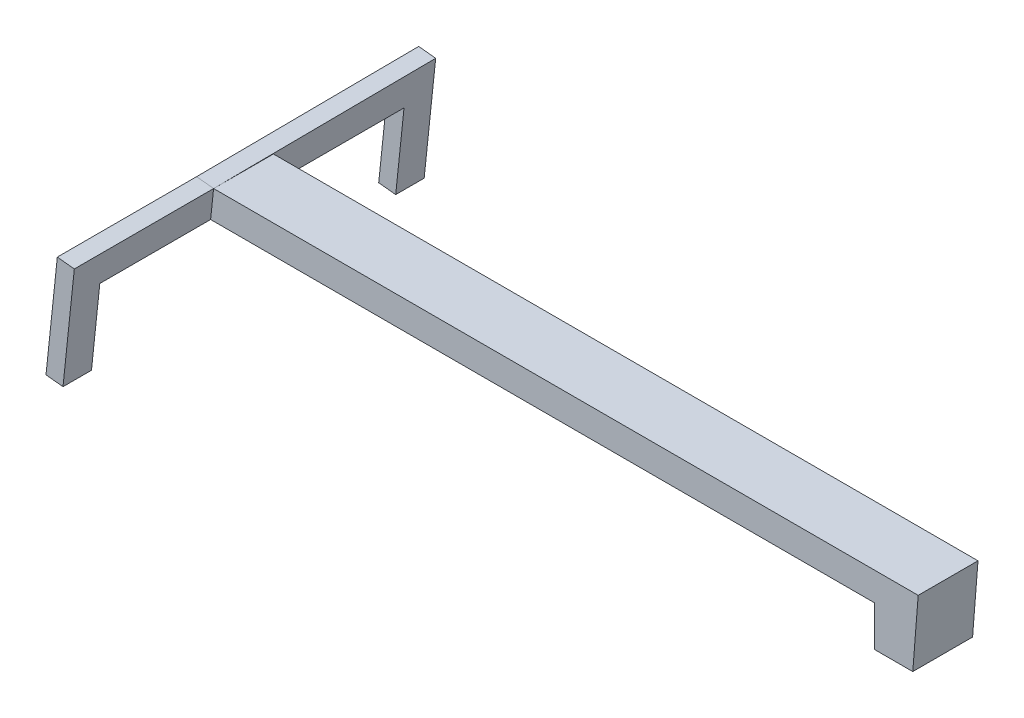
ISO-10303-21;
HEADER;
FILE_DESCRIPTION(('STEP AP214'),'2;1');
FILE_NAME('part.step','',(''),(''),'','','');
FILE_SCHEMA(('AUTOMOTIVE_DESIGN { 1 0 10303 214 1 1 1 1 }'));
ENDSEC;
DATA;
#1=APPLICATION_CONTEXT('core data for automotive mechanical design processes');
#2=APPLICATION_PROTOCOL_DEFINITION('international standard','automotive_design',2000,#1);
#3=PRODUCT_CONTEXT('',#1,'mechanical');
#4=PRODUCT('Part','Part','',(#3));
#5=PRODUCT_RELATED_PRODUCT_CATEGORY('part','',(#4));
#6=PRODUCT_DEFINITION_FORMATION('','',#4);
#7=PRODUCT_DEFINITION_CONTEXT('part definition',#1,'design');
#8=PRODUCT_DEFINITION('design','',#6,#7);
#9=PRODUCT_DEFINITION_SHAPE('','',#8);
#10=(LENGTH_UNIT() NAMED_UNIT(*) SI_UNIT(.MILLI.,.METRE.));
#11=(NAMED_UNIT(*) PLANE_ANGLE_UNIT() SI_UNIT($,.RADIAN.));
#12=(NAMED_UNIT(*) SI_UNIT($,.STERADIAN.) SOLID_ANGLE_UNIT());
#13=UNCERTAINTY_MEASURE_WITH_UNIT(LENGTH_MEASURE(1.E-05),#10,'distance_accuracy_value','');
#14=(GEOMETRIC_REPRESENTATION_CONTEXT(3) GLOBAL_UNCERTAINTY_ASSIGNED_CONTEXT((#13)) GLOBAL_UNIT_ASSIGNED_CONTEXT((#10,
#11,#12)) REPRESENTATION_CONTEXT('',''));
#15=CARTESIAN_POINT('',(0.,0.,0.));
#16=DIRECTION('',(0.,0.,1.));
#17=DIRECTION('',(1.,0.,0.));
#18=AXIS2_PLACEMENT_3D('',#15,#16,#17);
#19=CARTESIAN_POINT('',(-131.401996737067,-25.0946612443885,69.9));
#20=DIRECTION('',(0.104528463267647,0.994521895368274,0.));
#21=DIRECTION('',(-0.994521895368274,0.104528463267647,0.));
#22=AXIS2_PLACEMENT_3D('',#19,#20,#21);
#23=PLANE('',#22);
#24=DIRECTION('',(0.,0.,1.));
#25=VECTOR('',#24,1.);
#26=CARTESIAN_POINT('',(-131.401996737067,-25.0946612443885,69.9));
#27=LINE('',#26,#25);
#28=CARTESIAN_POINT('',(-131.401996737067,-25.0946612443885,59.9));
#29=VERTEX_POINT('',#28);
#30=CARTESIAN_POINT('',(-131.401996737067,-25.0946612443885,69.9));
#31=VERTEX_POINT('',#30);
#32=EDGE_CURVE('E262',#29,#31,#27,.T.);
#33=ORIENTED_EDGE('',*,*,#32,.F.);
#34=DIRECTION('',(-0.994521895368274,0.104528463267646,0.));
#35=VECTOR('',#34,1.);
#36=CARTESIAN_POINT('',(-15.6302798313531,-37.2627590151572,59.9));
#37=LINE('',#36,#35);
#38=CARTESIAN_POINT('',(-125.434865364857,-25.7218320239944,59.9));
#39=VERTEX_POINT('',#38);
#40=EDGE_CURVE('E281',#39,#29,#37,.T.);
#41=ORIENTED_EDGE('',*,*,#40,.F.);
#42=DIRECTION('',(0.,0.,1.));
#43=VECTOR('',#42,1.);
#44=CARTESIAN_POINT('',(-125.434865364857,-25.7218320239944,69.9));
#45=LINE('',#44,#43);
#46=CARTESIAN_POINT('',(-125.434865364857,-25.7218320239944,69.9));
#47=VERTEX_POINT('',#46);
#48=EDGE_CURVE('E238',#39,#47,#45,.T.);
#49=ORIENTED_EDGE('',*,*,#48,.T.);
#50=DIRECTION('',(0.994521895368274,-0.104528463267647,0.));
#51=VECTOR('',#50,1.);
#52=CARTESIAN_POINT('',(-131.401996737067,-25.0946612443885,69.9));
#53=LINE('',#52,#51);
#54=EDGE_CURVE('E250',#31,#47,#53,.T.);
#55=ORIENTED_EDGE('',*,*,#54,.F.);
#56=EDGE_LOOP('',(#33,#41,#49,#55));
#57=FACE_BOUND('',#56,.T.);
#58=ADVANCED_FACE('F33',(#57),#23,.F.);
#59=CARTESIAN_POINT('',(-121.390404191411,12.7586456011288,0.));
#60=DIRECTION('',(0.994521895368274,-0.104528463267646,0.));
#61=DIRECTION('',(0.104528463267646,0.994521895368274,0.));
#62=AXIS2_PLACEMENT_3D('',#59,#60,#61);
#63=PLANE('',#62);
#64=DIRECTION('',(0.104528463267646,0.994521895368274,0.));
#65=VECTOR('',#64,1.);
#66=CARTESIAN_POINT('',(-125.434865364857,-25.7218320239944,59.9));
#67=LINE('',#66,#65);
#68=CARTESIAN_POINT('',(-122.508068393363,2.12478104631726,59.9));
#69=VERTEX_POINT('',#68);
#70=EDGE_CURVE('E278',#39,#69,#67,.T.);
#71=ORIENTED_EDGE('',*,*,#70,.T.);
#72=DIRECTION('',(0.,0.,-1.));
#73=VECTOR('',#72,1.);
#74=CARTESIAN_POINT('',(-122.508068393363,2.12478104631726,-46.9));
#75=LINE('',#74,#73);
#76=CARTESIAN_POINT('',(-122.508068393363,2.12478104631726,21.));
#77=VERTEX_POINT('',#76);
#78=EDGE_CURVE('E212',#69,#77,#75,.T.);
#79=ORIENTED_EDGE('',*,*,#78,.T.);
#80=DIRECTION('',(0.104528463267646,0.994521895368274,0.));
#81=VECTOR('',#80,1.);
#82=CARTESIAN_POINT('',(-124.,-12.07,21.));
#83=LINE('',#82,#81);
#84=CARTESIAN_POINT('',(-121.462783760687,12.07,21.));
#85=VERTEX_POINT('',#84);
#86=EDGE_CURVE('E188',#77,#85,#83,.T.);
#87=ORIENTED_EDGE('',*,*,#86,.T.);
#88=DIRECTION('',(0.,0.,-1.));
#89=VECTOR('',#88,1.);
#90=CARTESIAN_POINT('',(-121.462783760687,12.07,21.));
#91=LINE('',#90,#89);
#92=CARTESIAN_POINT('',(-121.462783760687,12.07,69.9));
#93=VERTEX_POINT('',#92);
#94=EDGE_CURVE('E211',#93,#85,#91,.T.);
#95=ORIENTED_EDGE('',*,*,#94,.F.);
#96=DIRECTION('',(0.104528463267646,0.994521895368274,0.));
#97=VECTOR('',#96,1.);
#98=CARTESIAN_POINT('',(-121.462783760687,12.07,69.9));
#99=LINE('',#98,#97);
#100=EDGE_CURVE('E224',#47,#93,#99,.T.);
#101=ORIENTED_EDGE('',*,*,#100,.F.);
#102=ORIENTED_EDGE('',*,*,#48,.F.);
#103=EDGE_LOOP('',(#71,#79,#87,#95,#101,#102));
#104=FACE_BOUND('',#103,.T.);
#105=ADVANCED_FACE('F209',(#104),#63,.T.);
#106=CARTESIAN_POINT('',(124.,-12.07,21.));
#107=DIRECTION('',(0.,1.,0.));
#108=DIRECTION('',(-1.,0.,0.));
#109=AXIS2_PLACEMENT_3D('',#106,#107,#108);
#110=PLANE('',#109);
#111=DIRECTION('',(1.,0.,0.));
#112=VECTOR('',#111,1.);
#113=CARTESIAN_POINT('',(124.,-12.07,21.));
#114=LINE('',#113,#112);
#115=CARTESIAN_POINT('',(110.478386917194,-12.07,21.));
#116=VERTEX_POINT('',#115);
#117=CARTESIAN_POINT('',(124.,-12.07,21.));
#118=VERTEX_POINT('',#117);
#119=EDGE_CURVE('E56',#116,#118,#114,.T.);
#120=ORIENTED_EDGE('',*,*,#119,.F.);
#121=DIRECTION('',(0.,0.,1.));
#122=VECTOR('',#121,1.);
#123=CARTESIAN_POINT('',(110.478386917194,-12.07,-56.9));
#124=LINE('',#123,#122);
#125=CARTESIAN_POINT('',(110.478386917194,-12.07,0.));
#126=VERTEX_POINT('',#125);
#127=EDGE_CURVE('E140',#126,#116,#124,.T.);
#128=ORIENTED_EDGE('',*,*,#127,.F.);
#129=DIRECTION('',(1.,0.,0.));
#130=VECTOR('',#129,1.);
#131=CARTESIAN_POINT('',(124.,-12.07,0.));
#132=LINE('',#131,#130);
#133=CARTESIAN_POINT('',(124.,-12.07,0.));
#134=VERTEX_POINT('',#133);
#135=EDGE_CURVE('E162',#126,#134,#132,.T.);
#136=ORIENTED_EDGE('',*,*,#135,.T.);
#137=DIRECTION('',(0.,0.,-1.));
#138=VECTOR('',#137,1.);
#139=CARTESIAN_POINT('',(124.,-12.07,21.));
#140=LINE('',#139,#138);
#141=EDGE_CURVE('E154',#118,#134,#140,.T.);
#142=ORIENTED_EDGE('',*,*,#141,.F.);
#143=EDGE_LOOP('',(#120,#128,#136,#142));
#144=FACE_BOUND('',#143,.T.);
#145=ADVANCED_FACE('F35',(#144),#110,.F.);
#146=CARTESIAN_POINT('',(124.,12.07,21.));
#147=DIRECTION('',(0.,-1.,0.));
#148=DIRECTION('',(1.,0.,0.));
#149=AXIS2_PLACEMENT_3D('',#146,#147,#148);
#150=PLANE('',#149);
#151=DIRECTION('',(-1.,0.,0.));
#152=VECTOR('',#151,1.);
#153=CARTESIAN_POINT('',(124.,12.07,0.));
#154=LINE('',#153,#152);
#155=CARTESIAN_POINT('',(125.899859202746,12.07,0.));
#156=VERTEX_POINT('',#155);
#157=CARTESIAN_POINT('',(-121.462783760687,12.07,0.));
#158=VERTEX_POINT('',#157);
#159=EDGE_CURVE('E157',#156,#158,#154,.T.);
#160=ORIENTED_EDGE('',*,*,#159,.T.);
#161=DIRECTION('',(0.,0.,1.));
#162=VECTOR('',#161,1.);
#163=CARTESIAN_POINT('',(-121.462783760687,12.07,0.));
#164=LINE('',#163,#162);
#165=EDGE_CURVE('E185',#158,#85,#164,.T.);
#166=ORIENTED_EDGE('',*,*,#165,.T.);
#167=DIRECTION('',(-1.,0.,0.));
#168=VECTOR('',#167,1.);
#169=CARTESIAN_POINT('',(124.,12.07,21.));
#170=LINE('',#169,#168);
#171=CARTESIAN_POINT('',(125.899859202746,12.07,21.));
#172=VERTEX_POINT('',#171);
#173=EDGE_CURVE('E156',#172,#85,#170,.T.);
#174=ORIENTED_EDGE('',*,*,#173,.F.);
#175=DIRECTION('',(0.,0.,1.));
#176=VECTOR('',#175,1.);
#177=CARTESIAN_POINT('',(125.899859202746,12.07,-24.2146456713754));
#178=LINE('',#177,#176);
#179=EDGE_CURVE('E165',#156,#172,#178,.T.);
#180=ORIENTED_EDGE('',*,*,#179,.F.);
#181=EDGE_LOOP('',(#160,#166,#174,#180));
#182=FACE_BOUND('',#181,.T.);
#183=ADVANCED_FACE('F204',(#182),#150,.F.);
#184=CARTESIAN_POINT('',(0.,0.,21.));
#185=DIRECTION('',(0.,0.,1.));
#186=DIRECTION('',(1.,0.,0.));
#187=AXIS2_PLACEMENT_3D('',#184,#185,#186);
#188=PLANE('',#187);
#189=DIRECTION('',(-1.,0.,0.));
#190=VECTOR('',#189,1.);
#191=CARTESIAN_POINT('',(-122.508068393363,2.12478104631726,21.));
#192=LINE('',#191,#190);
#193=CARTESIAN_POINT('',(110.478386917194,2.12478104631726,21.));
#194=VERTEX_POINT('',#193);
#195=EDGE_CURVE('E148',#194,#77,#192,.T.);
#196=ORIENTED_EDGE('',*,*,#195,.F.);
#197=DIRECTION('',(0.,1.,0.));
#198=VECTOR('',#197,1.);
#199=CARTESIAN_POINT('',(110.478386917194,2.12478104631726,21.));
#200=LINE('',#199,#198);
#201=EDGE_CURVE('E143',#116,#194,#200,.T.);
#202=ORIENTED_EDGE('',*,*,#201,.F.);
#203=ORIENTED_EDGE('',*,*,#119,.T.);
#204=DIRECTION('',(0.0784590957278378,0.996917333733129,0.));
#205=VECTOR('',#204,1.);
#206=CARTESIAN_POINT('',(124.,-12.07,21.));
#207=LINE('',#206,#205);
#208=EDGE_CURVE('E190',#118,#172,#207,.T.);
#209=ORIENTED_EDGE('',*,*,#208,.T.);
#210=ORIENTED_EDGE('',*,*,#173,.T.);
#211=ORIENTED_EDGE('',*,*,#86,.F.);
#212=EDGE_LOOP('',(#196,#202,#203,#209,#210,#211));
#213=FACE_BOUND('',#212,.T.);
#214=ADVANCED_FACE('F150',(#213),#188,.T.);
#215=CARTESIAN_POINT('',(0.,0.,0.));
#216=DIRECTION('',(0.,0.,1.));
#217=DIRECTION('',(1.,0.,0.));
#218=AXIS2_PLACEMENT_3D('',#215,#216,#217);
#219=PLANE('',#218);
#220=DIRECTION('',(0.,1.,0.));
#221=VECTOR('',#220,1.);
#222=CARTESIAN_POINT('',(110.478386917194,0.,0.));
#223=LINE('',#222,#221);
#224=CARTESIAN_POINT('',(110.478386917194,2.12478104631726,0.));
#225=VERTEX_POINT('',#224);
#226=EDGE_CURVE('E11',#126,#225,#223,.T.);
#227=ORIENTED_EDGE('',*,*,#226,.T.);
#228=DIRECTION('',(-1.,0.,0.));
#229=VECTOR('',#228,1.);
#230=CARTESIAN_POINT('',(0.,2.12478104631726,0.));
#231=LINE('',#230,#229);
#232=CARTESIAN_POINT('',(-122.508068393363,2.12478104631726,0.));
#233=VERTEX_POINT('',#232);
#234=EDGE_CURVE('E296',#225,#233,#231,.T.);
#235=ORIENTED_EDGE('',*,*,#234,.T.);
#236=DIRECTION('',(0.104528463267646,0.994521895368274,0.));
#237=VECTOR('',#236,1.);
#238=CARTESIAN_POINT('',(-124.,-12.07,0.));
#239=LINE('',#238,#237);
#240=EDGE_CURVE('E181',#233,#158,#239,.T.);
#241=ORIENTED_EDGE('',*,*,#240,.T.);
#242=ORIENTED_EDGE('',*,*,#159,.F.);
#243=DIRECTION('',(-0.0784590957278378,-0.996917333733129,0.));
#244=VECTOR('',#243,1.);
#245=CARTESIAN_POINT('',(124.,-12.07,0.));
#246=LINE('',#245,#244);
#247=EDGE_CURVE('E168',#156,#134,#246,.T.);
#248=ORIENTED_EDGE('',*,*,#247,.T.);
#249=ORIENTED_EDGE('',*,*,#135,.F.);
#250=EDGE_LOOP('',(#227,#235,#241,#242,#248,#249));
#251=FACE_BOUND('',#250,.T.);
#252=ADVANCED_FACE('F302',(#251),#219,.F.);
#253=CARTESIAN_POINT('',(124.,-12.07,-24.2146456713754));
#254=DIRECTION('',(0.996917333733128,-0.0784590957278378,0.));
#255=DIRECTION('',(0.0784590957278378,0.996917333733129,0.));
#256=AXIS2_PLACEMENT_3D('',#253,#254,#255);
#257=PLANE('',#256);
#258=ORIENTED_EDGE('',*,*,#247,.F.);
#259=ORIENTED_EDGE('',*,*,#179,.T.);
#260=ORIENTED_EDGE('',*,*,#208,.F.);
#261=ORIENTED_EDGE('',*,*,#141,.T.);
#262=EDGE_LOOP('',(#258,#259,#260,#261));
#263=FACE_BOUND('',#262,.T.);
#264=ADVANCED_FACE('F202',(#263),#257,.T.);
#265=CARTESIAN_POINT('',(-127.357535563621,13.3858163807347,-56.9));
#266=DIRECTION('',(-0.104524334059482,-0.994482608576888,-0.00888846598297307));
#267=DIRECTION('',(0.994521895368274,-0.104528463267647,0.));
#268=AXIS2_PLACEMENT_3D('',#265,#266,#267);
#269=PLANE('',#268);
#270=DIRECTION('',(0.000929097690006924,0.00883977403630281,-0.999960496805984));
#271=VECTOR('',#270,1.);
#272=CARTESIAN_POINT('',(-121.390404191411,12.7586456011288,-56.9));
#273=LINE('',#272,#271);
#274=CARTESIAN_POINT('',(-121.390404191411,12.7586456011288,-56.9));
#275=VERTEX_POINT('',#274);
#276=EDGE_CURVE('E230',#85,#275,#273,.T.);
#277=ORIENTED_EDGE('',*,*,#276,.T.);
#278=DIRECTION('',(0.994521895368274,-0.104528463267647,0.));
#279=VECTOR('',#278,1.);
#280=CARTESIAN_POINT('',(-127.357535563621,13.3858163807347,-56.9));
#281=LINE('',#280,#279);
#282=CARTESIAN_POINT('',(-127.357535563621,13.3858163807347,-56.9));
#283=VERTEX_POINT('',#282);
#284=EDGE_CURVE('E192',#283,#275,#281,.T.);
#285=ORIENTED_EDGE('',*,*,#284,.F.);
#286=DIRECTION('',(0.000929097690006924,0.00883977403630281,-0.999960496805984));
#287=VECTOR('',#286,1.);
#288=CARTESIAN_POINT('',(-127.357535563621,13.3858163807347,-56.9));
#289=LINE('',#288,#287);
#290=CARTESIAN_POINT('',(-127.429915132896,12.6971707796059,21.));
#291=VERTEX_POINT('',#290);
#292=EDGE_CURVE('E223',#291,#283,#289,.T.);
#293=ORIENTED_EDGE('',*,*,#292,.F.);
#294=DIRECTION('',(0.994521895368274,-0.104528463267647,0.));
#295=VECTOR('',#294,1.);
#296=CARTESIAN_POINT('',(-127.429915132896,12.6971707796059,21.));
#297=LINE('',#296,#295);
#298=EDGE_CURVE('E219',#291,#85,#297,.T.);
#299=ORIENTED_EDGE('',*,*,#298,.T.);
#300=EDGE_LOOP('',(#277,#285,#293,#299));
#301=FACE_BOUND('',#300,.T.);
#302=ADVANCED_FACE('F228',(#301),#269,.F.);
#303=CARTESIAN_POINT('',(-131.401996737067,-25.0946612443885,-56.9));
#304=DIRECTION('',(0.,0.,1.));
#305=DIRECTION('',(0.,-1.,0.));
#306=AXIS2_PLACEMENT_3D('',#303,#304,#305);
#307=PLANE('',#306);
#308=DIRECTION('',(-0.104528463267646,-0.994521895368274,0.));
#309=VECTOR('',#308,1.);
#310=CARTESIAN_POINT('',(-125.434865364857,-25.7218320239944,-56.9));
#311=LINE('',#310,#309);
#312=CARTESIAN_POINT('',(-125.434865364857,-25.7218320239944,-56.9));
#313=VERTEX_POINT('',#312);
#314=EDGE_CURVE('E234',#275,#313,#311,.T.);
#315=ORIENTED_EDGE('',*,*,#314,.T.);
#316=DIRECTION('',(0.994521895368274,-0.104528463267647,0.));
#317=VECTOR('',#316,1.);
#318=CARTESIAN_POINT('',(-131.401996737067,-25.0946612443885,-56.9));
#319=LINE('',#318,#317);
#320=CARTESIAN_POINT('',(-131.401996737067,-25.0946612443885,-56.9));
#321=VERTEX_POINT('',#320);
#322=EDGE_CURVE('E252',#321,#313,#319,.T.);
#323=ORIENTED_EDGE('',*,*,#322,.F.);
#324=DIRECTION('',(-0.104528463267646,-0.994521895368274,0.));
#325=VECTOR('',#324,1.);
#326=CARTESIAN_POINT('',(-131.401996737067,-25.0946612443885,-56.9));
#327=LINE('',#326,#325);
#328=EDGE_CURVE('E259',#283,#321,#327,.T.);
#329=ORIENTED_EDGE('',*,*,#328,.F.);
#330=ORIENTED_EDGE('',*,*,#284,.T.);
#331=EDGE_LOOP('',(#315,#323,#329,#330));
#332=FACE_BOUND('',#331,.T.);
#333=ADVANCED_FACE('F258',(#332),#307,.F.);
#334=CARTESIAN_POINT('',(-125.434865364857,-25.7218320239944,-46.9));
#335=VERTEX_POINT('',#334);
#336=EDGE_CURVE('E245',#313,#335,#45,.T.);
#337=ORIENTED_EDGE('',*,*,#336,.T.);
#338=DIRECTION('',(-0.994521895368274,0.104528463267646,0.));
#339=VECTOR('',#338,1.);
#340=CARTESIAN_POINT('',(-15.6302798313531,-37.2627590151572,-46.9));
#341=LINE('',#340,#339);
#342=CARTESIAN_POINT('',(-131.401996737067,-25.0946612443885,-46.9));
#343=VERTEX_POINT('',#342);
#344=EDGE_CURVE('E236',#335,#343,#341,.T.);
#345=ORIENTED_EDGE('',*,*,#344,.T.);
#346=EDGE_CURVE('E269',#321,#343,#27,.T.);
#347=ORIENTED_EDGE('',*,*,#346,.F.);
#348=ORIENTED_EDGE('',*,*,#322,.T.);
#349=EDGE_LOOP('',(#337,#345,#347,#348));
#350=FACE_BOUND('',#349,.T.);
#351=ADVANCED_FACE('F313',(#350),#23,.F.);
#352=CARTESIAN_POINT('',(-127.429915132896,12.6971707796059,69.9));
#353=DIRECTION('',(0.,0.,-1.));
#354=DIRECTION('',(-1.,0.,0.));
#355=AXIS2_PLACEMENT_3D('',#352,#353,#354);
#356=PLANE('',#355);
#357=ORIENTED_EDGE('',*,*,#100,.T.);
#358=DIRECTION('',(0.994521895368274,-0.104528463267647,0.));
#359=VECTOR('',#358,1.);
#360=CARTESIAN_POINT('',(-127.429915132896,12.6971707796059,69.9));
#361=LINE('',#360,#359);
#362=CARTESIAN_POINT('',(-127.429915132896,12.6971707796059,69.9));
#363=VERTEX_POINT('',#362);
#364=EDGE_CURVE('E222',#363,#93,#361,.T.);
#365=ORIENTED_EDGE('',*,*,#364,.F.);
#366=DIRECTION('',(0.104528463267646,0.994521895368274,0.));
#367=VECTOR('',#366,1.);
#368=CARTESIAN_POINT('',(-127.429915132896,12.6971707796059,69.9));
#369=LINE('',#368,#367);
#370=EDGE_CURVE('E270',#31,#363,#369,.T.);
#371=ORIENTED_EDGE('',*,*,#370,.F.);
#372=ORIENTED_EDGE('',*,*,#54,.T.);
#373=EDGE_LOOP('',(#357,#365,#371,#372));
#374=FACE_BOUND('',#373,.T.);
#375=ADVANCED_FACE('F276',(#374),#356,.F.);
#376=CARTESIAN_POINT('',(-127.429915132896,12.6971707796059,21.));
#377=DIRECTION('',(-0.104528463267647,-0.994521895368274,0.));
#378=DIRECTION('',(0.994521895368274,-0.104528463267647,0.));
#379=AXIS2_PLACEMENT_3D('',#376,#377,#378);
#380=PLANE('',#379);
#381=ORIENTED_EDGE('',*,*,#94,.T.);
#382=ORIENTED_EDGE('',*,*,#298,.F.);
#383=DIRECTION('',(0.,0.,-1.));
#384=VECTOR('',#383,1.);
#385=CARTESIAN_POINT('',(-127.429915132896,12.6971707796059,21.));
#386=LINE('',#385,#384);
#387=EDGE_CURVE('E232',#363,#291,#386,.T.);
#388=ORIENTED_EDGE('',*,*,#387,.F.);
#389=ORIENTED_EDGE('',*,*,#364,.T.);
#390=EDGE_LOOP('',(#381,#382,#388,#389));
#391=FACE_BOUND('',#390,.T.);
#392=ADVANCED_FACE('F217',(#391),#380,.F.);
#393=CARTESIAN_POINT('',(-127.357535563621,13.3858163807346,0.));
#394=DIRECTION('',(0.994521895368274,-0.104528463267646,0.));
#395=DIRECTION('',(0.104528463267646,0.994521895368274,0.));
#396=AXIS2_PLACEMENT_3D('',#393,#394,#395);
#397=PLANE('',#396);
#398=DIRECTION('',(0.,0.,-1.));
#399=VECTOR('',#398,1.);
#400=CARTESIAN_POINT('',(-128.475199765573,2.75195182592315,-46.9));
#401=LINE('',#400,#399);
#402=CARTESIAN_POINT('',(-128.475199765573,2.75195182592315,59.9));
#403=VERTEX_POINT('',#402);
#404=CARTESIAN_POINT('',(-128.475199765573,2.75195182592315,-46.9));
#405=VERTEX_POINT('',#404);
#406=EDGE_CURVE('E284',#403,#405,#401,.T.);
#407=ORIENTED_EDGE('',*,*,#406,.F.);
#408=DIRECTION('',(0.104528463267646,0.994521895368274,0.));
#409=VECTOR('',#408,1.);
#410=CARTESIAN_POINT('',(-131.401996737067,-25.0946612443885,59.9));
#411=LINE('',#410,#409);
#412=EDGE_CURVE('E287',#29,#403,#411,.T.);
#413=ORIENTED_EDGE('',*,*,#412,.F.);
#414=ORIENTED_EDGE('',*,*,#32,.T.);
#415=ORIENTED_EDGE('',*,*,#370,.T.);
#416=ORIENTED_EDGE('',*,*,#387,.T.);
#417=ORIENTED_EDGE('',*,*,#292,.T.);
#418=ORIENTED_EDGE('',*,*,#328,.T.);
#419=ORIENTED_EDGE('',*,*,#346,.T.);
#420=DIRECTION('',(-0.104528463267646,-0.994521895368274,0.));
#421=VECTOR('',#420,1.);
#422=CARTESIAN_POINT('',(-131.401996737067,-25.0946612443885,-46.9));
#423=LINE('',#422,#421);
#424=EDGE_CURVE('E294',#405,#343,#423,.T.);
#425=ORIENTED_EDGE('',*,*,#424,.F.);
#426=EDGE_LOOP('',(#407,#413,#414,#415,#416,#417,#418,#419,#425));
#427=FACE_BOUND('',#426,.T.);
#428=ADVANCED_FACE('F265',(#427),#397,.F.);
#429=ORIENTED_EDGE('',*,*,#336,.F.);
#430=ORIENTED_EDGE('',*,*,#314,.F.);
#431=ORIENTED_EDGE('',*,*,#276,.F.);
#432=ORIENTED_EDGE('',*,*,#165,.F.);
#433=ORIENTED_EDGE('',*,*,#240,.F.);
#434=DIRECTION('',(0.,0.,1.));
#435=VECTOR('',#434,1.);
#436=CARTESIAN_POINT('',(-122.508068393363,2.12478104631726,0.));
#437=LINE('',#436,#435);
#438=CARTESIAN_POINT('',(-122.508068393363,2.12478104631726,-46.9));
#439=VERTEX_POINT('',#438);
#440=EDGE_CURVE('E41',#439,#233,#437,.T.);
#441=ORIENTED_EDGE('',*,*,#440,.F.);
#442=DIRECTION('',(-0.104528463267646,-0.994521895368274,0.));
#443=VECTOR('',#442,1.);
#444=CARTESIAN_POINT('',(-125.434865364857,-25.7218320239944,-46.9));
#445=LINE('',#444,#443);
#446=EDGE_CURVE('E48',#439,#335,#445,.T.);
#447=ORIENTED_EDGE('',*,*,#446,.T.);
#448=EDGE_LOOP('',(#429,#430,#431,#432,#433,#441,#447));
#449=FACE_BOUND('',#448,.T.);
#450=ADVANCED_FACE('F182',(#449),#63,.T.);
#451=CARTESIAN_POINT('',(-15.6302798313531,-37.2627590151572,59.9));
#452=DIRECTION('',(0.,0.,1.));
#453=DIRECTION('',(1.,0.,0.));
#454=AXIS2_PLACEMENT_3D('',#451,#452,#453);
#455=PLANE('',#454);
#456=ORIENTED_EDGE('',*,*,#40,.T.);
#457=ORIENTED_EDGE('',*,*,#412,.T.);
#458=DIRECTION('',(-0.994521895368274,0.104528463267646,0.));
#459=VECTOR('',#458,1.);
#460=CARTESIAN_POINT('',(-12.703482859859,-9.41614594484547,59.9));
#461=LINE('',#460,#459);
#462=EDGE_CURVE('E285',#69,#403,#461,.T.);
#463=ORIENTED_EDGE('',*,*,#462,.F.);
#464=ORIENTED_EDGE('',*,*,#70,.F.);
#465=EDGE_LOOP('',(#456,#457,#463,#464));
#466=FACE_BOUND('',#465,.T.);
#467=ADVANCED_FACE('F329',(#466),#455,.F.);
#468=CARTESIAN_POINT('',(-12.703482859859,-9.41614594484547,-46.9));
#469=DIRECTION('',(0.104528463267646,0.994521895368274,0.));
#470=DIRECTION('',(-0.994521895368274,0.104528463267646,0.));
#471=AXIS2_PLACEMENT_3D('',#468,#469,#470);
#472=PLANE('',#471);
#473=ORIENTED_EDGE('',*,*,#462,.T.);
#474=ORIENTED_EDGE('',*,*,#406,.T.);
#475=DIRECTION('',(-0.994521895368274,0.104528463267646,0.));
#476=VECTOR('',#475,1.);
#477=CARTESIAN_POINT('',(-12.703482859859,-9.41614594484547,-46.9));
#478=LINE('',#477,#476);
#479=EDGE_CURVE('E179',#439,#405,#478,.T.);
#480=ORIENTED_EDGE('',*,*,#479,.F.);
#481=ORIENTED_EDGE('',*,*,#440,.T.);
#482=EDGE_CURVE('E176',#77,#233,#75,.T.);
#483=ORIENTED_EDGE('',*,*,#482,.F.);
#484=ORIENTED_EDGE('',*,*,#78,.F.);
#485=EDGE_LOOP('',(#473,#474,#480,#481,#483,#484));
#486=FACE_BOUND('',#485,.T.);
#487=ADVANCED_FACE('F175',(#486),#472,.F.);
#488=CARTESIAN_POINT('',(-15.6302798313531,-37.2627590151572,-46.9));
#489=DIRECTION('',(0.,0.,-1.));
#490=DIRECTION('',(-1.,0.,0.));
#491=AXIS2_PLACEMENT_3D('',#488,#489,#490);
#492=PLANE('',#491);
#493=ORIENTED_EDGE('',*,*,#479,.T.);
#494=ORIENTED_EDGE('',*,*,#424,.T.);
#495=ORIENTED_EDGE('',*,*,#344,.F.);
#496=ORIENTED_EDGE('',*,*,#446,.F.);
#497=EDGE_LOOP('',(#493,#494,#495,#496));
#498=FACE_BOUND('',#497,.T.);
#499=ADVANCED_FACE('F327',(#498),#492,.F.);
#500=CARTESIAN_POINT('',(110.478386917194,2.12478104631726,-56.9));
#501=DIRECTION('',(1.,0.,0.));
#502=DIRECTION('',(0.,0.,-1.));
#503=AXIS2_PLACEMENT_3D('',#500,#501,#502);
#504=PLANE('',#503);
#505=ORIENTED_EDGE('',*,*,#127,.T.);
#506=ORIENTED_EDGE('',*,*,#201,.T.);
#507=DIRECTION('',(0.,0.,1.));
#508=VECTOR('',#507,1.);
#509=CARTESIAN_POINT('',(110.478386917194,2.12478104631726,-56.9));
#510=LINE('',#509,#508);
#511=EDGE_CURVE('E147',#225,#194,#510,.T.);
#512=ORIENTED_EDGE('',*,*,#511,.F.);
#513=ORIENTED_EDGE('',*,*,#226,.F.);
#514=EDGE_LOOP('',(#505,#506,#512,#513));
#515=FACE_BOUND('',#514,.T.);
#516=ADVANCED_FACE('F141',(#515),#504,.F.);
#517=CARTESIAN_POINT('',(-122.508068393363,2.12478104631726,-56.9));
#518=DIRECTION('',(0.,1.,0.));
#519=DIRECTION('',(0.,0.,1.));
#520=AXIS2_PLACEMENT_3D('',#517,#518,#519);
#521=PLANE('',#520);
#522=ORIENTED_EDGE('',*,*,#511,.T.);
#523=ORIENTED_EDGE('',*,*,#195,.T.);
#524=ORIENTED_EDGE('',*,*,#482,.T.);
#525=ORIENTED_EDGE('',*,*,#234,.F.);
#526=EDGE_LOOP('',(#522,#523,#524,#525));
#527=FACE_BOUND('',#526,.T.);
#528=ADVANCED_FACE('F301',(#527),#521,.F.);
#529=CLOSED_SHELL('',(#58,#105,#145,#183,#214,#252,#264,#302,#333,#351,#375,#392,#428,#450,#467,
#487,#499,#516,#528));
#530=MANIFOLD_SOLID_BREP('B2',#529);
#531=ADVANCED_BREP_SHAPE_REPRESENTATION('',(#18,#530),#14);
#532=SHAPE_DEFINITION_REPRESENTATION(#9,#531);
ENDSEC;
END-ISO-10303-21;
